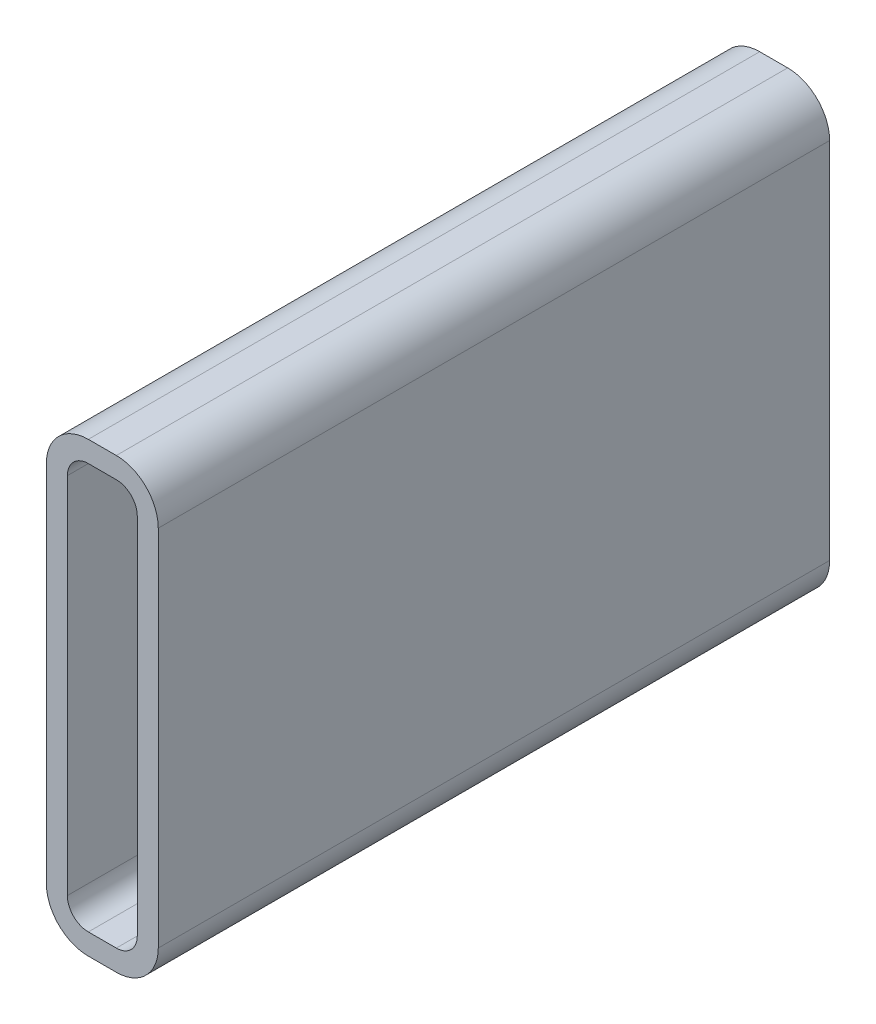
from build123d import *

# Parameters (mm, degrees)
BOSS_EXTRUDE1_DEPTH = 304.8


with BuildPart() as part:
    # Sketch1 → Boss-Extrude1 (new body)
    with BuildSketch(Plane.XY):
        with BuildLine():
            Line((19.05, 203.2), (31.75, 203.2))
            ThreePointArc((31.75, 203.2), (45.220384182, 197.620384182), (50.8, 184.15))
            Line((50.8, 184.15), (50.8, 19.05))
            ThreePointArc((50.8, 19.05), (45.220384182, 5.579615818), (31.75, 0))
            Line((31.75, 0), (19.05, 0))
            ThreePointArc((19.05, 0), (5.579615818, 5.579615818), (0, 19.05))
            Line((0, 19.05), (0, 184.15))
            ThreePointArc((0, 184.15), (5.579615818, 197.620384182), (19.05, 203.2))
        make_face()
        with BuildLine():
            Line((19.05, 193.675), (31.75, 193.675))
            ThreePointArc((31.75, 193.675), (38.485192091, 190.885192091), (41.275, 184.15))
            Line((41.275, 184.15), (41.275, 19.05))
            ThreePointArc((41.275, 19.05), (38.485192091, 12.314807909), (31.75, 9.525))
            Line((31.75, 9.525), (19.05, 9.525))
            ThreePointArc((19.05, 9.525), (12.314807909, 12.314807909), (9.525, 19.05))
            Line((9.525, 19.05), (9.525, 184.15))
            ThreePointArc((9.525, 184.15), (12.314807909, 190.885192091), (19.05, 193.675))
        make_face(mode=Mode.SUBTRACT)
    extrude(amount=BOSS_EXTRUDE1_DEPTH)


solid = part.part
